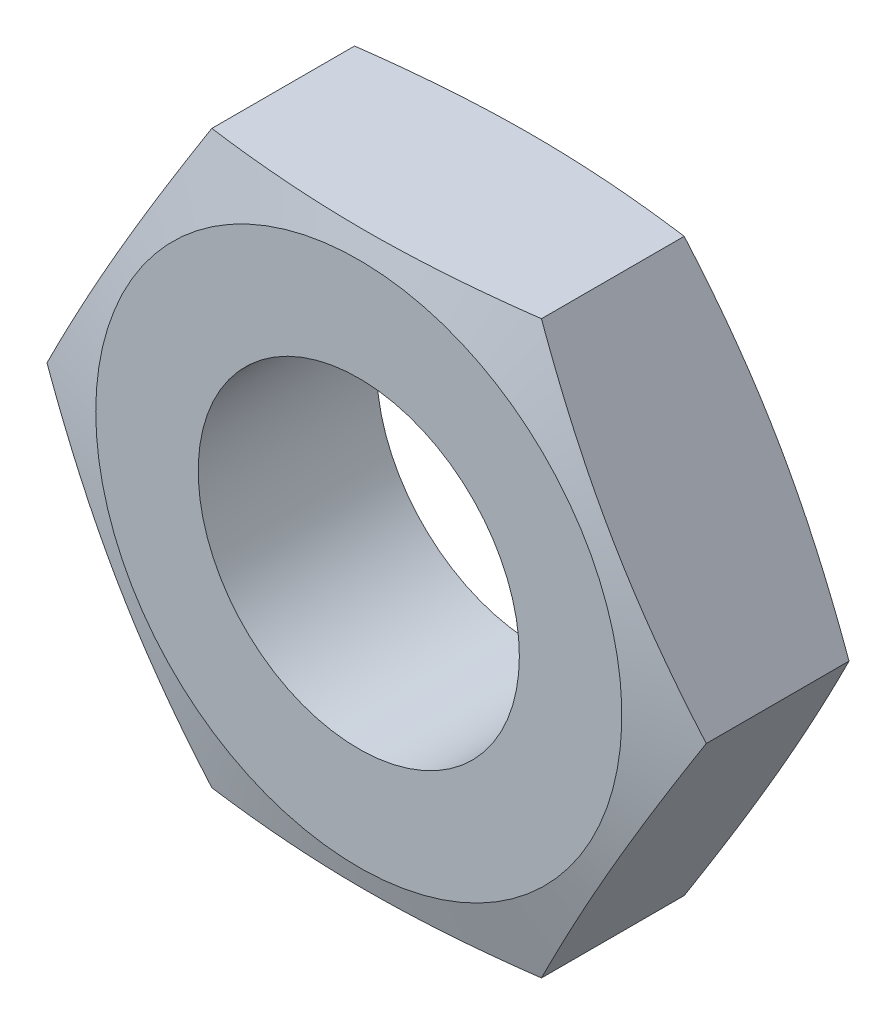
ISO-10303-21;
HEADER;
FILE_DESCRIPTION(('STEP AP214'),'2;1');
FILE_NAME('part.step','',(''),(''),'','','');
FILE_SCHEMA(('AUTOMOTIVE_DESIGN { 1 0 10303 214 1 1 1 1 }'));
ENDSEC;
DATA;
#1=APPLICATION_CONTEXT('core data for automotive mechanical design processes');
#2=APPLICATION_PROTOCOL_DEFINITION('international standard','automotive_design',2000,#1);
#3=PRODUCT_CONTEXT('',#1,'mechanical');
#4=PRODUCT('Part','Part','',(#3));
#5=PRODUCT_RELATED_PRODUCT_CATEGORY('part','',(#4));
#6=PRODUCT_DEFINITION_FORMATION('','',#4);
#7=PRODUCT_DEFINITION_CONTEXT('part definition',#1,'design');
#8=PRODUCT_DEFINITION('design','',#6,#7);
#9=PRODUCT_DEFINITION_SHAPE('','',#8);
#10=(LENGTH_UNIT() NAMED_UNIT(*) SI_UNIT(.MILLI.,.METRE.));
#11=(NAMED_UNIT(*) PLANE_ANGLE_UNIT() SI_UNIT($,.RADIAN.));
#12=(NAMED_UNIT(*) SI_UNIT($,.STERADIAN.) SOLID_ANGLE_UNIT());
#13=UNCERTAINTY_MEASURE_WITH_UNIT(LENGTH_MEASURE(1.E-05),#10,'distance_accuracy_value','');
#14=(GEOMETRIC_REPRESENTATION_CONTEXT(3) GLOBAL_UNCERTAINTY_ASSIGNED_CONTEXT((#13)) GLOBAL_UNIT_ASSIGNED_CONTEXT((#10,
#11,#12)) REPRESENTATION_CONTEXT('',''));
#15=CARTESIAN_POINT('',(0.,0.,0.));
#16=DIRECTION('',(0.,0.,1.));
#17=DIRECTION('',(1.,0.,0.));
#18=AXIS2_PLACEMENT_3D('',#15,#16,#17);
#19=CARTESIAN_POINT('',(-4.61880215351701,8.,-2.5));
#20=DIRECTION('',(0.,0.,-1.));
#21=DIRECTION('',(-1.,0.,0.));
#22=AXIS2_PLACEMENT_3D('',#19,#20,#21);
#23=PLANE('',#22);
#24=CARTESIAN_POINT('',(0.,0.,-2.5));
#25=DIRECTION('',(0.,0.,1.));
#26=DIRECTION('',(1.,0.,0.));
#27=AXIS2_PLACEMENT_3D('',#24,#25,#26);
#28=CIRCLE('',#27,4.5);
#29=CARTESIAN_POINT('',(4.5,0.,-2.5));
#30=VERTEX_POINT('',#29);
#31=EDGE_CURVE('E116',#30,#30,#28,.T.);
#32=ORIENTED_EDGE('',*,*,#31,.T.);
#33=EDGE_LOOP('',(#32));
#34=FACE_BOUND('',#33,.T.);
#35=CARTESIAN_POINT('',(0.,0.,-2.5));
#36=DIRECTION('',(0.,0.,-1.));
#37=DIRECTION('',(-1.,0.,0.));
#38=AXIS2_PLACEMENT_3D('',#35,#36,#37);
#39=CIRCLE('',#38,7.37157890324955);
#40=CARTESIAN_POINT('',(-7.37157890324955,0.,-2.5));
#41=VERTEX_POINT('',#40);
#42=EDGE_CURVE('E93',#41,#41,#39,.T.);
#43=ORIENTED_EDGE('',*,*,#42,.T.);
#44=EDGE_LOOP('',(#43));
#45=FACE_BOUND('',#44,.T.);
#46=ADVANCED_FACE('F28',(#34,#45),#23,.T.);
#47=CARTESIAN_POINT('',(-9.23760430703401,0.,2.5));
#48=DIRECTION('',(-0.866025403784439,0.5,0.));
#49=DIRECTION('',(-0.5,-0.866025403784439,0.));
#50=AXIS2_PLACEMENT_3D('',#47,#48,#49);
#51=PLANE('',#50);
#52=CARTESIAN_POINT('',(-4.61868668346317,8.0002,1.9999690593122));
#53=CARTESIAN_POINT('',(-4.8105035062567,7.66796351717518,2.05138759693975));
#54=CARTESIAN_POINT('',(-5.0026681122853,7.33512465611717,2.09806712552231));
#55=CARTESIAN_POINT('',(-5.38767596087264,6.66827150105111,2.18007865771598));
#56=CARTESIAN_POINT('',(-5.58051944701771,6.33425678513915,2.21540605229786));
#57=CARTESIAN_POINT('',(-5.96571585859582,5.66707702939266,2.27265094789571));
#58=CARTESIAN_POINT('',(-6.15806617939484,5.33391650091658,2.29463671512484));
#59=CARTESIAN_POINT('',(-6.54301211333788,4.66717058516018,2.32411737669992));
#60=CARTESIAN_POINT('',(-6.73560767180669,4.33358529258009,2.33161507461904));
#61=CARTESIAN_POINT('',(-7.12079878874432,3.66641470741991,2.33161507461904));
#62=CARTESIAN_POINT('',(-7.31339434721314,3.33282941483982,2.32411737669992));
#63=CARTESIAN_POINT('',(-7.69834028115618,2.66608349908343,2.29463671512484));
#64=CARTESIAN_POINT('',(-7.8906906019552,2.33292297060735,2.27265094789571));
#65=CARTESIAN_POINT('',(-8.27588701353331,1.66574321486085,2.21540605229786));
#66=CARTESIAN_POINT('',(-8.46873049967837,1.33172849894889,2.18007865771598));
#67=CARTESIAN_POINT('',(-8.85373834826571,0.664875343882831,2.09806712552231));
#68=CARTESIAN_POINT('',(-9.04590295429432,0.332036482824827,2.05138759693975));
#69=CARTESIAN_POINT('',(-9.23771977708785,-0.000199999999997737,1.9999690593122));
#70=B_SPLINE_CURVE_WITH_KNOTS('',3,(#52,#53,#54,#55,#56,#57,#58,#59,#60,#61,#62,#63,#64,#65,#66,
#67,#68,#69),.UNSPECIFIED.,.F.,.F.,(4,2,2,2,2,2,2,2,4),(0.,1.1612532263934,2.32297733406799,
3.47870589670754,4.63421079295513,5.78971568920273,6.94544425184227,8.10716835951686,
9.26842158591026),.UNSPECIFIED.);
#71=CARTESIAN_POINT('',(-4.618802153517,8.,2.));
#72=VERTEX_POINT('',#71);
#73=CARTESIAN_POINT('',(-9.23760430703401,0.,2.));
#74=VERTEX_POINT('',#73);
#75=EDGE_CURVE('E85',#72,#74,#70,.T.);
#76=ORIENTED_EDGE('',*,*,#75,.F.);
#77=DIRECTION('',(0.,0.,-1.));
#78=VECTOR('',#77,1.);
#79=CARTESIAN_POINT('',(-4.61880215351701,8.,2.5));
#80=LINE('',#79,#78);
#81=CARTESIAN_POINT('',(-4.61880215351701,8.,-2.));
#82=VERTEX_POINT('',#81);
#83=EDGE_CURVE('E56',#72,#82,#80,.T.);
#84=ORIENTED_EDGE('',*,*,#83,.T.);
#85=CARTESIAN_POINT('',(-4.61868668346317,8.0002,-1.9999690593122));
#86=CARTESIAN_POINT('',(-4.8105035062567,7.66796351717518,-2.05138759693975));
#87=CARTESIAN_POINT('',(-5.0026681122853,7.33512465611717,-2.09806712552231));
#88=CARTESIAN_POINT('',(-5.38767596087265,6.66827150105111,-2.18007865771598));
#89=CARTESIAN_POINT('',(-5.58051944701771,6.33425678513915,-2.21540605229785));
#90=CARTESIAN_POINT('',(-5.96571585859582,5.66707702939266,-2.27265094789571));
#91=CARTESIAN_POINT('',(-6.15806617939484,5.33391650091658,-2.29463671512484));
#92=CARTESIAN_POINT('',(-6.54301211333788,4.66717058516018,-2.32411737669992));
#93=CARTESIAN_POINT('',(-6.7356076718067,4.33358529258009,-2.33161507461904));
#94=CARTESIAN_POINT('',(-7.12079878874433,3.66641470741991,-2.33161507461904));
#95=CARTESIAN_POINT('',(-7.31339434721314,3.33282941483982,-2.32411737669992));
#96=CARTESIAN_POINT('',(-7.69834028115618,2.66608349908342,-2.29463671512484));
#97=CARTESIAN_POINT('',(-7.8906906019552,2.33292297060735,-2.27265094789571));
#98=CARTESIAN_POINT('',(-8.27588701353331,1.66574321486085,-2.21540605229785));
#99=CARTESIAN_POINT('',(-8.46873049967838,1.33172849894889,-2.18007865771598));
#100=CARTESIAN_POINT('',(-8.85373834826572,0.664875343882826,-2.09806712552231));
#101=CARTESIAN_POINT('',(-9.04590295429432,0.332036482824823,-2.05138759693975));
#102=CARTESIAN_POINT('',(-9.23771977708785,-0.000200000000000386,-1.9999690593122));
#103=B_SPLINE_CURVE_WITH_KNOTS('',3,(#85,#86,#87,#88,#89,#90,#91,#92,#93,#94,#95,#96,#97,#98,
#99,#100,#101,#102),.UNSPECIFIED.,.F.,.F.,(4,2,2,2,2,2,2,2,4),(0.,1.1612532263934,
2.322977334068,3.47870589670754,4.63421079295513,5.78971568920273,6.94544425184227,
8.10716835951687,9.26842158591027),.UNSPECIFIED.);
#104=CARTESIAN_POINT('',(-9.23760430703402,0.,-2.));
#105=VERTEX_POINT('',#104);
#106=EDGE_CURVE('E103',#82,#105,#103,.T.);
#107=ORIENTED_EDGE('',*,*,#106,.T.);
#108=DIRECTION('',(0.,0.,-1.));
#109=VECTOR('',#108,1.);
#110=CARTESIAN_POINT('',(-9.23760430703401,0.,2.5));
#111=LINE('',#110,#109);
#112=EDGE_CURVE('E41',#74,#105,#111,.T.);
#113=ORIENTED_EDGE('',*,*,#112,.F.);
#114=EDGE_LOOP('',(#76,#84,#107,#113));
#115=FACE_BOUND('',#114,.T.);
#116=ADVANCED_FACE('F30',(#115),#51,.T.);
#117=CARTESIAN_POINT('',(-4.61880215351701,-8.,2.5));
#118=DIRECTION('',(-0.866025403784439,-0.5,0.));
#119=DIRECTION('',(0.5,-0.866025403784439,0.));
#120=AXIS2_PLACEMENT_3D('',#117,#118,#119);
#121=PLANE('',#120);
#122=CARTESIAN_POINT('',(-9.23771977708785,0.000200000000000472,1.9999690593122));
#123=CARTESIAN_POINT('',(-9.04590295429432,-0.332036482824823,2.05138759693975));
#124=CARTESIAN_POINT('',(-8.85373834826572,-0.664875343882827,2.09806712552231));
#125=CARTESIAN_POINT('',(-8.46873049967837,-1.33172849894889,2.18007865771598));
#126=CARTESIAN_POINT('',(-8.27588701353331,-1.66574321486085,2.21540605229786));
#127=CARTESIAN_POINT('',(-7.8906906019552,-2.33292297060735,2.27265094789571));
#128=CARTESIAN_POINT('',(-7.69834028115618,-2.66608349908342,2.29463671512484));
#129=CARTESIAN_POINT('',(-7.31339434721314,-3.33282941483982,2.32411737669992));
#130=CARTESIAN_POINT('',(-7.12079878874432,-3.66641470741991,2.33161507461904));
#131=CARTESIAN_POINT('',(-6.73560767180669,-4.33358529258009,2.33161507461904));
#132=CARTESIAN_POINT('',(-6.54301211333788,-4.66717058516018,2.32411737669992));
#133=CARTESIAN_POINT('',(-6.15806617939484,-5.33391650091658,2.29463671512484));
#134=CARTESIAN_POINT('',(-5.96571585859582,-5.66707702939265,2.27265094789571));
#135=CARTESIAN_POINT('',(-5.58051944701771,-6.33425678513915,2.21540605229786));
#136=CARTESIAN_POINT('',(-5.38767596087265,-6.66827150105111,2.18007865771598));
#137=CARTESIAN_POINT('',(-5.0026681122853,-7.33512465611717,2.09806712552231));
#138=CARTESIAN_POINT('',(-4.8105035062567,-7.66796351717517,2.05138759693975));
#139=CARTESIAN_POINT('',(-4.61868668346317,-8.0002,1.9999690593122));
#140=B_SPLINE_CURVE_WITH_KNOTS('',3,(#122,#123,#124,#125,#126,#127,#128,#129,#130,#131,#132,
#133,#134,#135,#136,#137,#138,#139),.UNSPECIFIED.,.F.,.F.,(4,2,2,2,2,2,2,2,4),(0.,
1.1612532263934,2.322977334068,3.47870589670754,4.63421079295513,5.78971568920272,
6.94544425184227,8.10716835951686,9.26842158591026),.UNSPECIFIED.);
#141=CARTESIAN_POINT('',(-4.61880215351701,-8.,2.));
#142=VERTEX_POINT('',#141);
#143=EDGE_CURVE('E89',#74,#142,#140,.T.);
#144=ORIENTED_EDGE('',*,*,#143,.F.);
#145=ORIENTED_EDGE('',*,*,#112,.T.);
#146=CARTESIAN_POINT('',(-9.23771977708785,0.000200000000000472,-1.9999690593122));
#147=CARTESIAN_POINT('',(-9.04590295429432,-0.332036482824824,-2.05138759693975));
#148=CARTESIAN_POINT('',(-8.85373834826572,-0.664875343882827,-2.09806712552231));
#149=CARTESIAN_POINT('',(-8.46873049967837,-1.33172849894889,-2.18007865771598));
#150=CARTESIAN_POINT('',(-8.27588701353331,-1.66574321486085,-2.21540605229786));
#151=CARTESIAN_POINT('',(-7.8906906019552,-2.33292297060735,-2.27265094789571));
#152=CARTESIAN_POINT('',(-7.69834028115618,-2.66608349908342,-2.29463671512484));
#153=CARTESIAN_POINT('',(-7.31339434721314,-3.33282941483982,-2.32411737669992));
#154=CARTESIAN_POINT('',(-7.12079878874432,-3.66641470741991,-2.33161507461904));
#155=CARTESIAN_POINT('',(-6.73560767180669,-4.33358529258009,-2.33161507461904));
#156=CARTESIAN_POINT('',(-6.54301211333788,-4.66717058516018,-2.32411737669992));
#157=CARTESIAN_POINT('',(-6.15806617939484,-5.33391650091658,-2.29463671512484));
#158=CARTESIAN_POINT('',(-5.96571585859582,-5.66707702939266,-2.27265094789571));
#159=CARTESIAN_POINT('',(-5.58051944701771,-6.33425678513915,-2.21540605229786));
#160=CARTESIAN_POINT('',(-5.38767596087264,-6.66827150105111,-2.18007865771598));
#161=CARTESIAN_POINT('',(-5.0026681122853,-7.33512465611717,-2.09806712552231));
#162=CARTESIAN_POINT('',(-4.81050350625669,-7.66796351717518,-2.05138759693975));
#163=CARTESIAN_POINT('',(-4.61868668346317,-8.0002,-1.9999690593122));
#164=B_SPLINE_CURVE_WITH_KNOTS('',3,(#146,#147,#148,#149,#150,#151,#152,#153,#154,#155,#156,
#157,#158,#159,#160,#161,#162,#163),.UNSPECIFIED.,.F.,.F.,(4,2,2,2,2,2,2,2,4),(0.,
1.1612532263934,2.322977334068,3.47870589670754,4.63421079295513,5.78971568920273,
6.94544425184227,8.10716835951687,9.26842158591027),.UNSPECIFIED.);
#165=CARTESIAN_POINT('',(-4.61880215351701,-8.,-2.));
#166=VERTEX_POINT('',#165);
#167=EDGE_CURVE('E122',#105,#166,#164,.T.);
#168=ORIENTED_EDGE('',*,*,#167,.T.);
#169=DIRECTION('',(0.,0.,-1.));
#170=VECTOR('',#169,1.);
#171=CARTESIAN_POINT('',(-4.61880215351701,-8.,2.5));
#172=LINE('',#171,#170);
#173=EDGE_CURVE('E100',#142,#166,#172,.T.);
#174=ORIENTED_EDGE('',*,*,#173,.F.);
#175=EDGE_LOOP('',(#144,#145,#168,#174));
#176=FACE_BOUND('',#175,.T.);
#177=ADVANCED_FACE('F97',(#176),#121,.T.);
#178=CARTESIAN_POINT('',(4.61880215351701,-8.,2.5));
#179=DIRECTION('',(0.,-1.,0.));
#180=DIRECTION('',(0.,0.,-1.));
#181=AXIS2_PLACEMENT_3D('',#178,#179,#180);
#182=PLANE('',#181);
#183=CARTESIAN_POINT('',(-12.1993152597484,-8.,0.566241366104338));
#184=CARTESIAN_POINT('',(-11.8365907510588,-8.,0.647494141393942));
#185=CARTESIAN_POINT('',(-11.4736388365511,-8.,0.727749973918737));
#186=CARTESIAN_POINT('',(-10.7471685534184,-8.,0.88572964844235));
#187=CARTESIAN_POINT('',(-10.3836501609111,-8.,0.96345338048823));
#188=CARTESIAN_POINT('',(-9.65560716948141,-8.,1.11589889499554));
#189=CARTESIAN_POINT('',(-9.29108193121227,-8.,1.19061763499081));
#190=CARTESIAN_POINT('',(-8.56127132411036,-8.,1.33624361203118));
#191=CARTESIAN_POINT('',(-8.19598596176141,-8.,1.40715088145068));
#192=CARTESIAN_POINT('',(-7.46745052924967,-8.,1.54369760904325));
#193=CARTESIAN_POINT('',(-7.10420753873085,-8.,1.60937465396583));
#194=CARTESIAN_POINT('',(-6.37672969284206,-8.,1.73497380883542));
#195=CARTESIAN_POINT('',(-6.0124948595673,-8.,1.7948960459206));
#196=CARTESIAN_POINT('',(-5.28296473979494,-8.,1.90763239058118));
#197=CARTESIAN_POINT('',(-4.91766959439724,-8.,1.96044740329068));
#198=CARTESIAN_POINT('',(-4.18591751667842,-8.,2.05740945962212));
#199=CARTESIAN_POINT('',(-3.8194605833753,-8.,2.10155649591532));
#200=CARTESIAN_POINT('',(-3.08125735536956,-8.,2.17992854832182));
#201=CARTESIAN_POINT('',(-2.70949828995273,-8.,2.21403506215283));
#202=CARTESIAN_POINT('',(-1.96504970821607,-8.,2.26997052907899));
#203=CARTESIAN_POINT('',(-1.59236021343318,-8.,2.29179976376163));
#204=CARTESIAN_POINT('',(-0.846591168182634,-8.,2.32190731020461));
#205=CARTESIAN_POINT('',(-0.473511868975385,-8.,2.33019172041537));
#206=CARTESIAN_POINT('',(0.272694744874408,-8.,2.33270076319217));
#207=CARTESIAN_POINT('',(0.645822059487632,-8.,2.32692540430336));
#208=CARTESIAN_POINT('',(1.39296578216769,-8.,2.30163951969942));
#209=CARTESIAN_POINT('',(1.76698046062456,-8.,2.28207890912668));
#210=CARTESIAN_POINT('',(2.51412769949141,-8.,2.23033695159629));
#211=CARTESIAN_POINT('',(2.88726024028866,-8.,2.19815532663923));
#212=CARTESIAN_POINT('',(3.63264094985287,-8.,2.12279217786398));
#213=CARTESIAN_POINT('',(4.00488838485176,-8.,2.07960350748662));
#214=CARTESIAN_POINT('',(4.74818594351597,-8.,1.98401756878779));
#215=CARTESIAN_POINT('',(5.11923606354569,-8.,1.93162027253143));
#216=CARTESIAN_POINT('',(5.83625128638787,-8.,1.82291517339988));
#217=CARTESIAN_POINT('',(6.18228855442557,-8.,1.76707859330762));
#218=CARTESIAN_POINT('',(6.87345087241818,-8.,1.64999426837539));
#219=CARTESIAN_POINT('',(7.21857589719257,-8.,1.58874637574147));
#220=CARTESIAN_POINT('',(7.90804037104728,-8.,1.46183047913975));
#221=CARTESIAN_POINT('',(8.25237974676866,-8.,1.39616207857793));
#222=CARTESIAN_POINT('',(8.94035162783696,-8.,1.26121287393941));
#223=CARTESIAN_POINT('',(9.28398412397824,-8.,1.19193202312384));
#224=CARTESIAN_POINT('',(10.3141257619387,-8.,0.979652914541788));
#225=CARTESIAN_POINT('',(10.999725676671,-8.,0.832246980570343));
#226=CARTESIAN_POINT('',(12.3691042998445,-8.,0.529471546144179));
#227=CARTESIAN_POINT('',(13.052883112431,-8.,0.374102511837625));
#228=CARTESIAN_POINT('',(14.4123687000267,-8.,0.0593227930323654));
#229=CARTESIAN_POINT('',(15.0880883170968,-8.,-0.100032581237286));
#230=CARTESIAN_POINT('',(16.4385864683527,-8.,-0.422724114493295));
#231=CARTESIAN_POINT('',(17.1133649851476,-8.,-0.586060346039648));
#232=CARTESIAN_POINT('',(18.4613709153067,-8.,-0.915470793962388));
#233=CARTESIAN_POINT('',(19.1345992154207,-8.,-1.08154138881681));
#234=CARTESIAN_POINT('',(20.4804704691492,-8.,-1.41594523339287));
#235=CARTESIAN_POINT('',(21.1531134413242,-8.,-1.58427840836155));
#236=CARTESIAN_POINT('',(21.8255524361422,-8.,-1.75341280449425));
#237=B_SPLINE_CURVE_WITH_KNOTS('',3,(#183,#184,#185,#186,#187,#188,#189,#190,#191,#192,#193,
#194,#195,#196,#197,#198,#199,#200,#201,#202,#203,#204,#205,#206,#207,#208,#209,#210,#211,#212,
#213,#214,#215,#216,#217,#218,#219,#220,#221,#222,#223,#224,#225,#226,#227,#228,#229,#230,#231,
#232,#233,#234,#235,#236),.UNSPECIFIED.,.F.,.F.,(4,2,2,2,2,2,2,2,2,2,2,2,2,2,2,2,2,2,2,2,2,2,2,
2,2,2,4),(0.,1.11514569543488,2.2303397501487,3.34663585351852,4.4629224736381,5.57028357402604,
6.67762020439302,7.78481567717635,8.89201208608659,10.0117954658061,11.1315531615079,
12.25080655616,13.3700592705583,14.4933995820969,15.6167646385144,16.7408609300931,
17.8649606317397,18.9164496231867,19.9679673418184,21.0195795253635,22.0712053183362,
24.1749250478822,26.2785217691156,28.3612721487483,30.444060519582,32.5242826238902,
34.6044361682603),.UNSPECIFIED.);
#238=CARTESIAN_POINT('',(4.618802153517,-8.,2.));
#239=VERTEX_POINT('',#238);
#240=EDGE_CURVE('E101',#142,#239,#237,.T.);
#241=ORIENTED_EDGE('',*,*,#240,.F.);
#242=ORIENTED_EDGE('',*,*,#173,.T.);
#243=CARTESIAN_POINT('',(-12.1993152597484,-8.,-0.566241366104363));
#244=CARTESIAN_POINT('',(-11.8365907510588,-8.,-0.647494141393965));
#245=CARTESIAN_POINT('',(-11.4736388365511,-8.,-0.727749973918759));
#246=CARTESIAN_POINT('',(-10.7471685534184,-8.,-0.885729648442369));
#247=CARTESIAN_POINT('',(-10.3836501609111,-8.,-0.963453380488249));
#248=CARTESIAN_POINT('',(-9.65560716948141,-8.,-1.11589889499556));
#249=CARTESIAN_POINT('',(-9.29108193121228,-8.,-1.19061763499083));
#250=CARTESIAN_POINT('',(-8.56127132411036,-8.,-1.33624361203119));
#251=CARTESIAN_POINT('',(-8.19598596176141,-8.,-1.40715088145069));
#252=CARTESIAN_POINT('',(-7.46745052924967,-8.,-1.54369760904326));
#253=CARTESIAN_POINT('',(-7.10420753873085,-8.,-1.60937465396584));
#254=CARTESIAN_POINT('',(-6.37672969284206,-8.,-1.73497380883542));
#255=CARTESIAN_POINT('',(-6.0124948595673,-8.,-1.7948960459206));
#256=CARTESIAN_POINT('',(-5.28296473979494,-8.,-1.90763239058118));
#257=CARTESIAN_POINT('',(-4.91766959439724,-8.,-1.96044740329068));
#258=CARTESIAN_POINT('',(-4.18591751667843,-8.,-2.05740945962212));
#259=CARTESIAN_POINT('',(-3.8194605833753,-8.,-2.10155649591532));
#260=CARTESIAN_POINT('',(-3.08125735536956,-8.,-2.17992854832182));
#261=CARTESIAN_POINT('',(-2.70949828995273,-8.,-2.21403506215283));
#262=CARTESIAN_POINT('',(-1.96504970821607,-8.,-2.26997052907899));
#263=CARTESIAN_POINT('',(-1.59236021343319,-8.,-2.29179976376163));
#264=CARTESIAN_POINT('',(-0.846591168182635,-8.,-2.3219073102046));
#265=CARTESIAN_POINT('',(-0.473511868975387,-8.,-2.33019172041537));
#266=CARTESIAN_POINT('',(0.272694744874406,-8.,-2.33270076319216));
#267=CARTESIAN_POINT('',(0.645822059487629,-8.,-2.32692540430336));
#268=CARTESIAN_POINT('',(1.39296578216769,-8.,-2.30163951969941));
#269=CARTESIAN_POINT('',(1.76698046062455,-8.,-2.28207890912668));
#270=CARTESIAN_POINT('',(2.5141276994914,-8.,-2.23033695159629));
#271=CARTESIAN_POINT('',(2.88726024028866,-8.,-2.19815532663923));
#272=CARTESIAN_POINT('',(3.63264094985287,-8.,-2.12279217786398));
#273=CARTESIAN_POINT('',(4.00488838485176,-8.,-2.07960350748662));
#274=CARTESIAN_POINT('',(4.74818594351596,-8.,-1.98401756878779));
#275=CARTESIAN_POINT('',(5.11923606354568,-8.,-1.93162027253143));
#276=CARTESIAN_POINT('',(5.83625128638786,-8.,-1.82291517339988));
#277=CARTESIAN_POINT('',(6.18228855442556,-8.,-1.76707859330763));
#278=CARTESIAN_POINT('',(6.87345087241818,-8.,-1.64999426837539));
#279=CARTESIAN_POINT('',(7.21857589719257,-8.,-1.58874637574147));
#280=CARTESIAN_POINT('',(7.90804037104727,-8.,-1.46183047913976));
#281=CARTESIAN_POINT('',(8.25237974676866,-8.,-1.39616207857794));
#282=CARTESIAN_POINT('',(8.94035162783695,-8.,-1.26121287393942));
#283=CARTESIAN_POINT('',(9.28398412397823,-8.,-1.19193202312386));
#284=CARTESIAN_POINT('',(10.3141257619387,-8.,-0.979652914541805));
#285=CARTESIAN_POINT('',(10.9997256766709,-8.,-0.832246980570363));
#286=CARTESIAN_POINT('',(12.3691042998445,-8.,-0.529471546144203));
#287=CARTESIAN_POINT('',(13.052883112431,-8.,-0.374102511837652));
#288=CARTESIAN_POINT('',(14.4123687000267,-8.,-0.0593227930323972));
#289=CARTESIAN_POINT('',(15.0880883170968,-8.,0.100032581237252));
#290=CARTESIAN_POINT('',(16.4385864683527,-8.,0.422724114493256));
#291=CARTESIAN_POINT('',(17.1133649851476,-8.,0.586060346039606));
#292=CARTESIAN_POINT('',(18.4613709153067,-8.,0.915470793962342));
#293=CARTESIAN_POINT('',(19.1345992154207,-8.,1.08154138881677));
#294=CARTESIAN_POINT('',(20.4804704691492,-8.,1.41594523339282));
#295=CARTESIAN_POINT('',(21.1531134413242,-8.,1.5842784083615));
#296=CARTESIAN_POINT('',(21.8255524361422,-8.,1.75341280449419));
#297=B_SPLINE_CURVE_WITH_KNOTS('',3,(#243,#244,#245,#246,#247,#248,#249,#250,#251,#252,#253,
#254,#255,#256,#257,#258,#259,#260,#261,#262,#263,#264,#265,#266,#267,#268,#269,#270,#271,#272,
#273,#274,#275,#276,#277,#278,#279,#280,#281,#282,#283,#284,#285,#286,#287,#288,#289,#290,#291,
#292,#293,#294,#295,#296),.UNSPECIFIED.,.F.,.F.,(4,2,2,2,2,2,2,2,2,2,2,2,2,2,2,2,2,2,2,2,2,2,2,
2,2,2,4),(0.,1.11514569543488,2.2303397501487,3.34663585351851,4.46292247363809,
5.57028357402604,6.67762020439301,7.78481567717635,8.89201208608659,10.0117954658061,
11.1315531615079,12.25080655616,13.3700592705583,14.4933995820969,15.6167646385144,
16.7408609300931,17.8649606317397,18.9164496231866,19.9679673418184,21.0195795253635,
22.0712053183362,24.1749250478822,26.2785217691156,28.3612721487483,30.444060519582,
32.5242826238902,34.6044361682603),.UNSPECIFIED.);
#298=CARTESIAN_POINT('',(4.61880215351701,-8.,-2.));
#299=VERTEX_POINT('',#298);
#300=EDGE_CURVE('E160',#166,#299,#297,.T.);
#301=ORIENTED_EDGE('',*,*,#300,.T.);
#302=DIRECTION('',(0.,0.,-1.));
#303=VECTOR('',#302,1.);
#304=CARTESIAN_POINT('',(4.61880215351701,-8.,2.5));
#305=LINE('',#304,#303);
#306=EDGE_CURVE('E105',#239,#299,#305,.T.);
#307=ORIENTED_EDGE('',*,*,#306,.F.);
#308=EDGE_LOOP('',(#241,#242,#301,#307));
#309=FACE_BOUND('',#308,.T.);
#310=ADVANCED_FACE('F166',(#309),#182,.T.);
#311=CARTESIAN_POINT('',(9.23760430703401,0.,2.5));
#312=DIRECTION('',(0.866025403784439,-0.5,0.));
#313=DIRECTION('',(0.5,0.866025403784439,0.));
#314=AXIS2_PLACEMENT_3D('',#311,#312,#313);
#315=PLANE('',#314);
#316=CARTESIAN_POINT('',(4.61868668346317,-8.0002,1.9999690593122));
#317=CARTESIAN_POINT('',(4.81050350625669,-7.66796351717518,2.05138759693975));
#318=CARTESIAN_POINT('',(5.0026681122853,-7.33512465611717,2.09806712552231));
#319=CARTESIAN_POINT('',(5.38767596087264,-6.66827150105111,2.18007865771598));
#320=CARTESIAN_POINT('',(5.58051944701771,-6.33425678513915,2.21540605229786));
#321=CARTESIAN_POINT('',(5.96571585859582,-5.66707702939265,2.27265094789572));
#322=CARTESIAN_POINT('',(6.15806617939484,-5.33391650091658,2.29463671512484));
#323=CARTESIAN_POINT('',(6.54301211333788,-4.66717058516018,2.32411737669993));
#324=CARTESIAN_POINT('',(6.73560767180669,-4.33358529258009,2.33161507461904));
#325=CARTESIAN_POINT('',(7.12079878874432,-3.66641470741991,2.33161507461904));
#326=CARTESIAN_POINT('',(7.31339434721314,-3.33282941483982,2.32411737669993));
#327=CARTESIAN_POINT('',(7.69834028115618,-2.66608349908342,2.29463671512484));
#328=CARTESIAN_POINT('',(7.8906906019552,-2.33292297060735,2.27265094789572));
#329=CARTESIAN_POINT('',(8.27588701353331,-1.66574321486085,2.21540605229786));
#330=CARTESIAN_POINT('',(8.46873049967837,-1.33172849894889,2.18007865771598));
#331=CARTESIAN_POINT('',(8.85373834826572,-0.664875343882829,2.09806712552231));
#332=CARTESIAN_POINT('',(9.04590295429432,-0.332036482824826,2.05138759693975));
#333=CARTESIAN_POINT('',(9.23771977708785,0.000199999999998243,1.99996905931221));
#334=B_SPLINE_CURVE_WITH_KNOTS('',3,(#316,#317,#318,#319,#320,#321,#322,#323,#324,#325,#326,
#327,#328,#329,#330,#331,#332,#333),.UNSPECIFIED.,.F.,.F.,(4,2,2,2,2,2,2,2,4),(0.,
1.1612532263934,2.322977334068,3.47870589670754,4.63421079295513,5.78971568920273,
6.94544425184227,8.10716835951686,9.26842158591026),.UNSPECIFIED.);
#335=CARTESIAN_POINT('',(9.23760430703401,0.,2.));
#336=VERTEX_POINT('',#335);
#337=EDGE_CURVE('E180',#239,#336,#334,.T.);
#338=ORIENTED_EDGE('',*,*,#337,.F.);
#339=ORIENTED_EDGE('',*,*,#306,.T.);
#340=CARTESIAN_POINT('',(4.61868668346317,-8.0002,-1.9999690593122));
#341=CARTESIAN_POINT('',(4.81050350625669,-7.66796351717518,-2.05138759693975));
#342=CARTESIAN_POINT('',(5.0026681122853,-7.33512465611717,-2.09806712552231));
#343=CARTESIAN_POINT('',(5.38767596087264,-6.66827150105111,-2.18007865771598));
#344=CARTESIAN_POINT('',(5.58051944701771,-6.33425678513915,-2.21540605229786));
#345=CARTESIAN_POINT('',(5.96571585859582,-5.66707702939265,-2.27265094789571));
#346=CARTESIAN_POINT('',(6.15806617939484,-5.33391650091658,-2.29463671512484));
#347=CARTESIAN_POINT('',(6.54301211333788,-4.66717058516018,-2.32411737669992));
#348=CARTESIAN_POINT('',(6.73560767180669,-4.33358529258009,-2.33161507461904));
#349=CARTESIAN_POINT('',(7.12079878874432,-3.66641470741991,-2.33161507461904));
#350=CARTESIAN_POINT('',(7.31339434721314,-3.33282941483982,-2.32411737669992));
#351=CARTESIAN_POINT('',(7.69834028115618,-2.66608349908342,-2.29463671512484));
#352=CARTESIAN_POINT('',(7.8906906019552,-2.33292297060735,-2.27265094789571));
#353=CARTESIAN_POINT('',(8.27588701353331,-1.66574321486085,-2.21540605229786));
#354=CARTESIAN_POINT('',(8.46873049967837,-1.33172849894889,-2.18007865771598));
#355=CARTESIAN_POINT('',(8.85373834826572,-0.664875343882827,-2.09806712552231));
#356=CARTESIAN_POINT('',(9.04590295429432,-0.332036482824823,-2.05138759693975));
#357=CARTESIAN_POINT('',(9.23771977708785,0.000200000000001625,-1.9999690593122));
#358=B_SPLINE_CURVE_WITH_KNOTS('',3,(#340,#341,#342,#343,#344,#345,#346,#347,#348,#349,#350,
#351,#352,#353,#354,#355,#356,#357),.UNSPECIFIED.,.F.,.F.,(4,2,2,2,2,2,2,2,4),(0.,
1.1612532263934,2.322977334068,3.47870589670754,4.63421079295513,5.78971568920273,
6.94544425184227,8.10716835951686,9.26842158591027),.UNSPECIFIED.);
#359=CARTESIAN_POINT('',(9.23760430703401,0.,-2.));
#360=VERTEX_POINT('',#359);
#361=EDGE_CURVE('E155',#299,#360,#358,.T.);
#362=ORIENTED_EDGE('',*,*,#361,.T.);
#363=DIRECTION('',(0.,0.,-1.));
#364=VECTOR('',#363,1.);
#365=CARTESIAN_POINT('',(9.23760430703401,0.,2.5));
#366=LINE('',#365,#364);
#367=EDGE_CURVE('E112',#336,#360,#366,.T.);
#368=ORIENTED_EDGE('',*,*,#367,.F.);
#369=EDGE_LOOP('',(#338,#339,#362,#368));
#370=FACE_BOUND('',#369,.T.);
#371=ADVANCED_FACE('F169',(#370),#315,.T.);
#372=CARTESIAN_POINT('',(4.61880215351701,8.,2.5));
#373=DIRECTION('',(0.866025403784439,0.5,0.));
#374=DIRECTION('',(-0.5,0.866025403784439,0.));
#375=AXIS2_PLACEMENT_3D('',#372,#373,#374);
#376=PLANE('',#375);
#377=CARTESIAN_POINT('',(9.23771977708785,-0.000199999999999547,1.99996905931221));
#378=CARTESIAN_POINT('',(9.04590295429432,0.332036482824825,2.05138759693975));
#379=CARTESIAN_POINT('',(8.85373834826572,0.664875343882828,2.09806712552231));
#380=CARTESIAN_POINT('',(8.46873049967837,1.33172849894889,2.18007865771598));
#381=CARTESIAN_POINT('',(8.27588701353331,1.66574321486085,2.21540605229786));
#382=CARTESIAN_POINT('',(7.8906906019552,2.33292297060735,2.27265094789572));
#383=CARTESIAN_POINT('',(7.69834028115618,2.66608349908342,2.29463671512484));
#384=CARTESIAN_POINT('',(7.31339434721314,3.33282941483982,2.32411737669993));
#385=CARTESIAN_POINT('',(7.12079878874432,3.66641470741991,2.33161507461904));
#386=CARTESIAN_POINT('',(6.73560767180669,4.33358529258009,2.33161507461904));
#387=CARTESIAN_POINT('',(6.54301211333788,4.66717058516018,2.32411737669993));
#388=CARTESIAN_POINT('',(6.15806617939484,5.33391650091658,2.29463671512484));
#389=CARTESIAN_POINT('',(5.96571585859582,5.66707702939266,2.27265094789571));
#390=CARTESIAN_POINT('',(5.58051944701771,6.33425678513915,2.21540605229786));
#391=CARTESIAN_POINT('',(5.38767596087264,6.66827150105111,2.18007865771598));
#392=CARTESIAN_POINT('',(5.0026681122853,7.33512465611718,2.09806712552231));
#393=CARTESIAN_POINT('',(4.81050350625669,7.66796351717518,2.05138759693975));
#394=CARTESIAN_POINT('',(4.61868668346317,8.0002,1.9999690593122));
#395=B_SPLINE_CURVE_WITH_KNOTS('',3,(#377,#378,#379,#380,#381,#382,#383,#384,#385,#386,#387,
#388,#389,#390,#391,#392,#393,#394),.UNSPECIFIED.,.F.,.F.,(4,2,2,2,2,2,2,2,4),(0.,
1.1612532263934,2.322977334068,3.47870589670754,4.63421079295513,5.78971568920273,
6.94544425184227,8.10716835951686,9.26842158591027),.UNSPECIFIED.);
#396=CARTESIAN_POINT('',(4.61880215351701,8.,2.));
#397=VERTEX_POINT('',#396);
#398=EDGE_CURVE('E48',#336,#397,#395,.T.);
#399=ORIENTED_EDGE('',*,*,#398,.F.);
#400=ORIENTED_EDGE('',*,*,#367,.T.);
#401=CARTESIAN_POINT('',(9.23771977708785,-0.000199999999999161,-1.9999690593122));
#402=CARTESIAN_POINT('',(9.04590295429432,0.332036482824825,-2.05138759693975));
#403=CARTESIAN_POINT('',(8.85373834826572,0.664875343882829,-2.09806712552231));
#404=CARTESIAN_POINT('',(8.46873049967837,1.33172849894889,-2.18007865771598));
#405=CARTESIAN_POINT('',(8.27588701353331,1.66574321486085,-2.21540605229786));
#406=CARTESIAN_POINT('',(7.8906906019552,2.33292297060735,-2.27265094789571));
#407=CARTESIAN_POINT('',(7.69834028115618,2.66608349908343,-2.29463671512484));
#408=CARTESIAN_POINT('',(7.31339434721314,3.33282941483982,-2.32411737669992));
#409=CARTESIAN_POINT('',(7.12079878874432,3.66641470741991,-2.33161507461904));
#410=CARTESIAN_POINT('',(6.73560767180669,4.33358529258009,-2.33161507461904));
#411=CARTESIAN_POINT('',(6.54301211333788,4.66717058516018,-2.32411737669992));
#412=CARTESIAN_POINT('',(6.15806617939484,5.33391650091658,-2.29463671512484));
#413=CARTESIAN_POINT('',(5.96571585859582,5.66707702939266,-2.27265094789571));
#414=CARTESIAN_POINT('',(5.58051944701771,6.33425678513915,-2.21540605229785));
#415=CARTESIAN_POINT('',(5.38767596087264,6.66827150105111,-2.18007865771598));
#416=CARTESIAN_POINT('',(5.0026681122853,7.33512465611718,-2.09806712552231));
#417=CARTESIAN_POINT('',(4.81050350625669,7.66796351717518,-2.05138759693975));
#418=CARTESIAN_POINT('',(4.61868668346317,8.0002,-1.9999690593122));
#419=B_SPLINE_CURVE_WITH_KNOTS('',3,(#401,#402,#403,#404,#405,#406,#407,#408,#409,#410,#411,
#412,#413,#414,#415,#416,#417,#418),.UNSPECIFIED.,.F.,.F.,(4,2,2,2,2,2,2,2,4),(0.,
1.1612532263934,2.322977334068,3.47870589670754,4.63421079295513,5.78971568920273,
6.94544425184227,8.10716835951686,9.26842158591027),.UNSPECIFIED.);
#420=CARTESIAN_POINT('',(4.618802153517,8.,-2.));
#421=VERTEX_POINT('',#420);
#422=EDGE_CURVE('E147',#360,#421,#419,.T.);
#423=ORIENTED_EDGE('',*,*,#422,.T.);
#424=DIRECTION('',(0.,0.,-1.));
#425=VECTOR('',#424,1.);
#426=CARTESIAN_POINT('',(4.61880215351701,8.,2.5));
#427=LINE('',#426,#425);
#428=EDGE_CURVE('E114',#397,#421,#427,.T.);
#429=ORIENTED_EDGE('',*,*,#428,.F.);
#430=EDGE_LOOP('',(#399,#400,#423,#429));
#431=FACE_BOUND('',#430,.T.);
#432=ADVANCED_FACE('F216',(#431),#376,.T.);
#433=CARTESIAN_POINT('',(-4.61880215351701,8.,2.5));
#434=DIRECTION('',(0.,1.,0.));
#435=DIRECTION('',(0.,0.,1.));
#436=AXIS2_PLACEMENT_3D('',#433,#434,#435);
#437=PLANE('',#436);
#438=CARTESIAN_POINT('',(-12.1993152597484,8.,0.566241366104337));
#439=CARTESIAN_POINT('',(-11.8365907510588,8.,0.647494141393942));
#440=CARTESIAN_POINT('',(-11.4736388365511,8.,0.727749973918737));
#441=CARTESIAN_POINT('',(-10.7471685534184,8.,0.885729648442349));
#442=CARTESIAN_POINT('',(-10.3836501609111,8.,0.963453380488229));
#443=CARTESIAN_POINT('',(-9.65560716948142,8.,1.11589889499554));
#444=CARTESIAN_POINT('',(-9.29108193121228,8.,1.19061763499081));
#445=CARTESIAN_POINT('',(-8.56127132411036,8.,1.33624361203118));
#446=CARTESIAN_POINT('',(-8.19598596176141,8.,1.40715088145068));
#447=CARTESIAN_POINT('',(-7.46745052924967,8.,1.54369760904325));
#448=CARTESIAN_POINT('',(-7.10420753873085,8.,1.60937465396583));
#449=CARTESIAN_POINT('',(-6.37672969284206,8.,1.73497380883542));
#450=CARTESIAN_POINT('',(-6.0124948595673,8.,1.7948960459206));
#451=CARTESIAN_POINT('',(-5.28296473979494,8.,1.90763239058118));
#452=CARTESIAN_POINT('',(-4.91766959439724,8.,1.96044740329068));
#453=CARTESIAN_POINT('',(-4.18591751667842,8.,2.05740945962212));
#454=CARTESIAN_POINT('',(-3.8194605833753,8.,2.10155649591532));
#455=CARTESIAN_POINT('',(-3.08125735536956,8.,2.17992854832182));
#456=CARTESIAN_POINT('',(-2.70949828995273,8.,2.21403506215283));
#457=CARTESIAN_POINT('',(-1.96504970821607,8.,2.26997052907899));
#458=CARTESIAN_POINT('',(-1.59236021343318,8.,2.29179976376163));
#459=CARTESIAN_POINT('',(-0.846591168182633,8.,2.32190731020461));
#460=CARTESIAN_POINT('',(-0.473511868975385,8.,2.33019172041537));
#461=CARTESIAN_POINT('',(0.272694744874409,8.,2.33270076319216));
#462=CARTESIAN_POINT('',(0.645822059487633,8.,2.32692540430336));
#463=CARTESIAN_POINT('',(1.39296578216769,8.,2.30163951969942));
#464=CARTESIAN_POINT('',(1.76698046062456,8.,2.28207890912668));
#465=CARTESIAN_POINT('',(2.51412769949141,8.,2.23033695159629));
#466=CARTESIAN_POINT('',(2.88726024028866,8.,2.19815532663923));
#467=CARTESIAN_POINT('',(3.63264094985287,8.,2.12279217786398));
#468=CARTESIAN_POINT('',(4.00488838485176,8.,2.07960350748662));
#469=CARTESIAN_POINT('',(4.74818594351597,8.,1.98401756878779));
#470=CARTESIAN_POINT('',(5.11923606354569,8.,1.93162027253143));
#471=CARTESIAN_POINT('',(5.83625128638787,8.,1.82291517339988));
#472=CARTESIAN_POINT('',(6.18228855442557,8.,1.76707859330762));
#473=CARTESIAN_POINT('',(6.87345087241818,8.,1.64999426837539));
#474=CARTESIAN_POINT('',(7.21857589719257,8.,1.58874637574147));
#475=CARTESIAN_POINT('',(7.90804037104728,8.,1.46183047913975));
#476=CARTESIAN_POINT('',(8.25237974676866,8.,1.39616207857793));
#477=CARTESIAN_POINT('',(8.94035162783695,8.,1.26121287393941));
#478=CARTESIAN_POINT('',(9.28398412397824,8.,1.19193202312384));
#479=CARTESIAN_POINT('',(10.3141257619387,8.,0.979652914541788));
#480=CARTESIAN_POINT('',(10.999725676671,8.,0.832246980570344));
#481=CARTESIAN_POINT('',(12.3691042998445,8.,0.52947154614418));
#482=CARTESIAN_POINT('',(13.052883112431,8.,0.374102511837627));
#483=CARTESIAN_POINT('',(14.4123687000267,8.,0.0593227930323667));
#484=CARTESIAN_POINT('',(15.0880883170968,8.,-0.100032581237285));
#485=CARTESIAN_POINT('',(16.4385864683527,8.,-0.422724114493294));
#486=CARTESIAN_POINT('',(17.1133649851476,8.,-0.586060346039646));
#487=CARTESIAN_POINT('',(18.4613709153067,8.,-0.915470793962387));
#488=CARTESIAN_POINT('',(19.1345992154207,8.,-1.08154138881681));
#489=CARTESIAN_POINT('',(20.4804704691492,8.,-1.41594523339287));
#490=CARTESIAN_POINT('',(21.1531134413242,8.,-1.58427840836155));
#491=CARTESIAN_POINT('',(21.8255524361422,8.,-1.75341280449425));
#492=B_SPLINE_CURVE_WITH_KNOTS('',3,(#438,#439,#440,#441,#442,#443,#444,#445,#446,#447,#448,
#449,#450,#451,#452,#453,#454,#455,#456,#457,#458,#459,#460,#461,#462,#463,#464,#465,#466,#467,
#468,#469,#470,#471,#472,#473,#474,#475,#476,#477,#478,#479,#480,#481,#482,#483,#484,#485,#486,
#487,#488,#489,#490,#491),.UNSPECIFIED.,.F.,.F.,(4,2,2,2,2,2,2,2,2,2,2,2,2,2,2,2,2,2,2,2,2,2,2,
2,2,2,4),(0.,1.11514569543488,2.2303397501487,3.34663585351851,4.4629224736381,5.57028357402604,
6.67762020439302,7.78481567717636,8.89201208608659,10.0117954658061,11.1315531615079,
12.25080655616,13.3700592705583,14.4933995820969,15.6167646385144,16.7408609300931,
17.8649606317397,18.9164496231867,19.9679673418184,21.0195795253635,22.0712053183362,
24.1749250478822,26.2785217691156,28.3612721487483,30.444060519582,32.5242826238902,
34.6044361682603),.UNSPECIFIED.);
#493=EDGE_CURVE('E91',#397,#72,#492,.F.);
#494=ORIENTED_EDGE('',*,*,#493,.F.);
#495=ORIENTED_EDGE('',*,*,#428,.T.);
#496=CARTESIAN_POINT('',(-12.1993152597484,8.,-0.566241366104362));
#497=CARTESIAN_POINT('',(-11.8365907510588,8.,-0.647494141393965));
#498=CARTESIAN_POINT('',(-11.4736388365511,8.,-0.727749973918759));
#499=CARTESIAN_POINT('',(-10.7471685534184,8.,-0.885729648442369));
#500=CARTESIAN_POINT('',(-10.3836501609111,8.,-0.963453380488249));
#501=CARTESIAN_POINT('',(-9.65560716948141,8.,-1.11589889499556));
#502=CARTESIAN_POINT('',(-9.29108193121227,8.,-1.19061763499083));
#503=CARTESIAN_POINT('',(-8.56127132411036,8.,-1.33624361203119));
#504=CARTESIAN_POINT('',(-8.19598596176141,8.,-1.40715088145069));
#505=CARTESIAN_POINT('',(-7.46745052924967,8.,-1.54369760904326));
#506=CARTESIAN_POINT('',(-7.10420753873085,8.,-1.60937465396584));
#507=CARTESIAN_POINT('',(-6.37672969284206,8.,-1.73497380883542));
#508=CARTESIAN_POINT('',(-6.0124948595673,8.,-1.7948960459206));
#509=CARTESIAN_POINT('',(-5.28296473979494,8.,-1.90763239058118));
#510=CARTESIAN_POINT('',(-4.91766959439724,8.,-1.96044740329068));
#511=CARTESIAN_POINT('',(-4.18591751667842,8.,-2.05740945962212));
#512=CARTESIAN_POINT('',(-3.8194605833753,8.,-2.10155649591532));
#513=CARTESIAN_POINT('',(-3.08125735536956,8.,-2.17992854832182));
#514=CARTESIAN_POINT('',(-2.70949828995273,8.,-2.21403506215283));
#515=CARTESIAN_POINT('',(-1.96504970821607,8.,-2.26997052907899));
#516=CARTESIAN_POINT('',(-1.59236021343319,8.,-2.29179976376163));
#517=CARTESIAN_POINT('',(-0.846591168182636,8.,-2.3219073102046));
#518=CARTESIAN_POINT('',(-0.473511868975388,8.,-2.33019172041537));
#519=CARTESIAN_POINT('',(0.272694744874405,8.,-2.33270076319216));
#520=CARTESIAN_POINT('',(0.645822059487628,8.,-2.32692540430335));
#521=CARTESIAN_POINT('',(1.39296578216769,8.,-2.30163951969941));
#522=CARTESIAN_POINT('',(1.76698046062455,8.,-2.28207890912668));
#523=CARTESIAN_POINT('',(2.5141276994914,8.,-2.23033695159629));
#524=CARTESIAN_POINT('',(2.88726024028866,8.,-2.19815532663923));
#525=CARTESIAN_POINT('',(3.63264094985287,8.,-2.12279217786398));
#526=CARTESIAN_POINT('',(4.00488838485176,8.,-2.07960350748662));
#527=CARTESIAN_POINT('',(4.74818594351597,8.,-1.98401756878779));
#528=CARTESIAN_POINT('',(5.11923606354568,8.,-1.93162027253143));
#529=CARTESIAN_POINT('',(5.83625128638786,8.,-1.82291517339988));
#530=CARTESIAN_POINT('',(6.18228855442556,8.,-1.76707859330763));
#531=CARTESIAN_POINT('',(6.87345087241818,8.,-1.64999426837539));
#532=CARTESIAN_POINT('',(7.21857589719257,8.,-1.58874637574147));
#533=CARTESIAN_POINT('',(7.90804037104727,8.,-1.46183047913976));
#534=CARTESIAN_POINT('',(8.25237974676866,8.,-1.39616207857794));
#535=CARTESIAN_POINT('',(8.94035162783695,8.,-1.26121287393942));
#536=CARTESIAN_POINT('',(9.28398412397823,8.,-1.19193202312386));
#537=CARTESIAN_POINT('',(10.3141257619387,8.,-0.979652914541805));
#538=CARTESIAN_POINT('',(10.999725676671,8.,-0.832246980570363));
#539=CARTESIAN_POINT('',(12.3691042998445,8.,-0.529471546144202));
#540=CARTESIAN_POINT('',(13.052883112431,8.,-0.37410251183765));
#541=CARTESIAN_POINT('',(14.4123687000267,8.,-0.0593227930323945));
#542=CARTESIAN_POINT('',(15.0880883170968,8.,0.100032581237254));
#543=CARTESIAN_POINT('',(16.4385864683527,8.,0.422724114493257));
#544=CARTESIAN_POINT('',(17.1133649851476,8.,0.586060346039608));
#545=CARTESIAN_POINT('',(18.4613709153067,8.,0.915470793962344));
#546=CARTESIAN_POINT('',(19.1345992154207,8.,1.08154138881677));
#547=CARTESIAN_POINT('',(20.4804704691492,8.,1.41594523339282));
#548=CARTESIAN_POINT('',(21.1531134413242,8.,1.5842784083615));
#549=CARTESIAN_POINT('',(21.8255524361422,8.,1.75341280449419));
#550=B_SPLINE_CURVE_WITH_KNOTS('',3,(#496,#497,#498,#499,#500,#501,#502,#503,#504,#505,#506,
#507,#508,#509,#510,#511,#512,#513,#514,#515,#516,#517,#518,#519,#520,#521,#522,#523,#524,#525,
#526,#527,#528,#529,#530,#531,#532,#533,#534,#535,#536,#537,#538,#539,#540,#541,#542,#543,#544,
#545,#546,#547,#548,#549),.UNSPECIFIED.,.F.,.F.,(4,2,2,2,2,2,2,2,2,2,2,2,2,2,2,2,2,2,2,2,2,2,2,
2,2,2,4),(0.,1.11514569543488,2.2303397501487,3.34663585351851,4.4629224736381,5.57028357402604,
6.67762020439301,7.78481567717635,8.89201208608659,10.0117954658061,11.1315531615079,
12.25080655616,13.3700592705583,14.4933995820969,15.6167646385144,16.7408609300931,
17.8649606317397,18.9164496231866,19.9679673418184,21.0195795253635,22.0712053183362,
24.1749250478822,26.2785217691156,28.3612721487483,30.444060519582,32.5242826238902,
34.6044361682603),.UNSPECIFIED.);
#551=EDGE_CURVE('E11',#421,#82,#550,.F.);
#552=ORIENTED_EDGE('',*,*,#551,.T.);
#553=ORIENTED_EDGE('',*,*,#83,.F.);
#554=EDGE_LOOP('',(#494,#495,#552,#553));
#555=FACE_BOUND('',#554,.T.);
#556=ADVANCED_FACE('F219',(#555),#437,.T.);
#557=CARTESIAN_POINT('',(-4.61880215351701,8.,2.5));
#558=DIRECTION('',(0.,0.,-1.));
#559=DIRECTION('',(-1.,0.,0.));
#560=AXIS2_PLACEMENT_3D('',#557,#558,#559);
#561=PLANE('',#560);
#562=CARTESIAN_POINT('',(0.,0.,2.5));
#563=DIRECTION('',(0.,0.,-1.));
#564=DIRECTION('',(-1.,0.,0.));
#565=AXIS2_PLACEMENT_3D('',#562,#563,#564);
#566=CIRCLE('',#565,7.37157890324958);
#567=CARTESIAN_POINT('',(-7.37157890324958,0.,2.5));
#568=VERTEX_POINT('',#567);
#569=EDGE_CURVE('E207',#568,#568,#566,.T.);
#570=ORIENTED_EDGE('',*,*,#569,.F.);
#571=EDGE_LOOP('',(#570));
#572=FACE_BOUND('',#571,.T.);
#573=CARTESIAN_POINT('',(0.,0.,2.5));
#574=DIRECTION('',(0.,0.,1.));
#575=DIRECTION('',(1.,0.,0.));
#576=AXIS2_PLACEMENT_3D('',#573,#574,#575);
#577=CIRCLE('',#576,4.5);
#578=CARTESIAN_POINT('',(4.5,0.,2.5));
#579=VERTEX_POINT('',#578);
#580=EDGE_CURVE('E108',#579,#579,#577,.T.);
#581=ORIENTED_EDGE('',*,*,#580,.F.);
#582=EDGE_LOOP('',(#581));
#583=FACE_BOUND('',#582,.T.);
#584=ADVANCED_FACE('F223',(#572,#583),#561,.F.);
#585=CARTESIAN_POINT('',(0.,0.,2.5));
#586=DIRECTION('',(0.,0.,-1.));
#587=DIRECTION('',(-1.,0.,0.));
#588=AXIS2_PLACEMENT_3D('',#585,#586,#587);
#589=CYLINDRICAL_SURFACE('',#588,4.5);
#590=ORIENTED_EDGE('',*,*,#580,.T.);
#591=EDGE_LOOP('',(#590));
#592=FACE_BOUND('',#591,.T.);
#593=ORIENTED_EDGE('',*,*,#31,.F.);
#594=EDGE_LOOP('',(#593));
#595=FACE_BOUND('',#594,.T.);
#596=ADVANCED_FACE('F138',(#592,#595),#589,.F.);
#597=CARTESIAN_POINT('',(0.,0.,-2.5));
#598=DIRECTION('',(0.,0.,1.));
#599=DIRECTION('',(1.,0.,0.));
#600=AXIS2_PLACEMENT_3D('',#597,#598,#599);
#601=CONICAL_SURFACE('',#600,7.37157890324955,1.30899693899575);
#602=ORIENTED_EDGE('',*,*,#551,.F.);
#603=ORIENTED_EDGE('',*,*,#422,.F.);
#604=ORIENTED_EDGE('',*,*,#361,.F.);
#605=ORIENTED_EDGE('',*,*,#300,.F.);
#606=ORIENTED_EDGE('',*,*,#167,.F.);
#607=ORIENTED_EDGE('',*,*,#106,.F.);
#608=EDGE_LOOP('',(#602,#603,#604,#605,#606,#607));
#609=FACE_BOUND('',#608,.T.);
#610=ORIENTED_EDGE('',*,*,#42,.F.);
#611=EDGE_LOOP('',(#610));
#612=FACE_BOUND('',#611,.T.);
#613=ADVANCED_FACE('F133',(#609,#612),#601,.T.);
#614=CARTESIAN_POINT('',(0.,0.,2.5));
#615=DIRECTION('',(0.,0.,-1.));
#616=DIRECTION('',(-1.,0.,0.));
#617=AXIS2_PLACEMENT_3D('',#614,#615,#616);
#618=CONICAL_SURFACE('',#617,7.37157890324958,1.30899693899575);
#619=ORIENTED_EDGE('',*,*,#75,.T.);
#620=ORIENTED_EDGE('',*,*,#143,.T.);
#621=ORIENTED_EDGE('',*,*,#240,.T.);
#622=ORIENTED_EDGE('',*,*,#337,.T.);
#623=ORIENTED_EDGE('',*,*,#398,.T.);
#624=ORIENTED_EDGE('',*,*,#493,.T.);
#625=EDGE_LOOP('',(#619,#620,#621,#622,#623,#624));
#626=FACE_BOUND('',#625,.T.);
#627=ORIENTED_EDGE('',*,*,#569,.T.);
#628=EDGE_LOOP('',(#627));
#629=FACE_BOUND('',#628,.T.);
#630=ADVANCED_FACE('F87',(#626,#629),#618,.T.);
#631=CLOSED_SHELL('',(#46,#116,#177,#310,#371,#432,#556,#584,#596,#613,#630));
#632=MANIFOLD_SOLID_BREP('B2',#631);
#633=ADVANCED_BREP_SHAPE_REPRESENTATION('',(#18,#632),#14);
#634=SHAPE_DEFINITION_REPRESENTATION(#9,#633);
ENDSEC;
END-ISO-10303-21;
